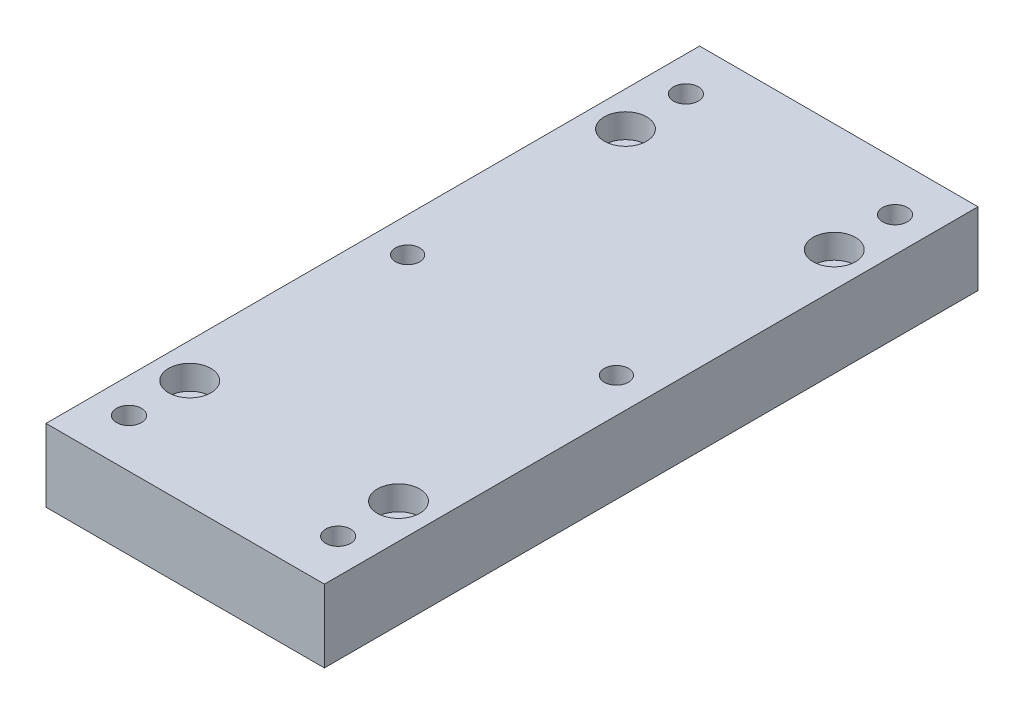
from build123d import *

# Parameters (mm, degrees)
SKETCH1_W                                        = 73.025
SKETCH1_H                                        = 171.45
BOSS_EXTRUDE1_DEPTH                              = 19.05
CBORE_FOR_1_4_SOCKET_HEAD_CAP_SCREW1_D           = 6.7564
CBORE_FOR_1_4_SOCKET_HEAD_CAP_SCREW1_CBORE_D     = 11.1125
CBORE_FOR_1_4_SOCKET_HEAD_CAP_SCREW1_CBORE_DEPTH = 6.35
F_1_4_0_2500_DOWEL_HOLE1_D                       = 6.35
F_5_16_18_TAPPED_HOLE1_D                         = 6.5278


with BuildPart() as part:
    # Sketch1 → Boss-Extrude1 (new body)
    with BuildSketch(Plane(origin=(0, 0, 0), x_dir=(1, 0, 0), z_dir=(0, 1, 0))):
        Rectangle(SKETCH1_W, SKETCH1_H)
    extrude(amount=BOSS_EXTRUDE1_DEPTH)

    # CBORE for 1_4 Socket Head Cap Screw1 (through all)
    with Locations(Plane(origin=(0, 19.05, 0), x_dir=(1, 0, 0), z_dir=(0, 1, 0))):
        with Locations((-27.3812, 57.15), (-27.3812, -57.15), (27.3812, 57.15), (27.3812, -57.15)):
            CounterBoreHole(CBORE_FOR_1_4_SOCKET_HEAD_CAP_SCREW1_D / 2, CBORE_FOR_1_4_SOCKET_HEAD_CAP_SCREW1_CBORE_D / 2, CBORE_FOR_1_4_SOCKET_HEAD_CAP_SCREW1_CBORE_DEPTH)

    # 1_4 _0.2500_ Dowel Hole1 (through all)
    with Locations(Plane(origin=(0, 0, 0), x_dir=(-1, 0, 0), z_dir=(0, -1, 0))):
        with Locations((27.3812, 0), (-27.3812, 0)):
            Hole(F_1_4_0_2500_DOWEL_HOLE1_D / 2)

    # 5_16-18 Tapped Hole1 (through all)
    with Locations(Plane(origin=(0, 19.05, 0), x_dir=(1, 0, 0), z_dir=(0, 1, 0))):
        with Locations((-27.432, 73.0377), (27.432, 73.0377), (27.432, -73.0377), (-27.432, -73.0377)):
            Hole(F_5_16_18_TAPPED_HOLE1_D / 2)


solid = part.part
